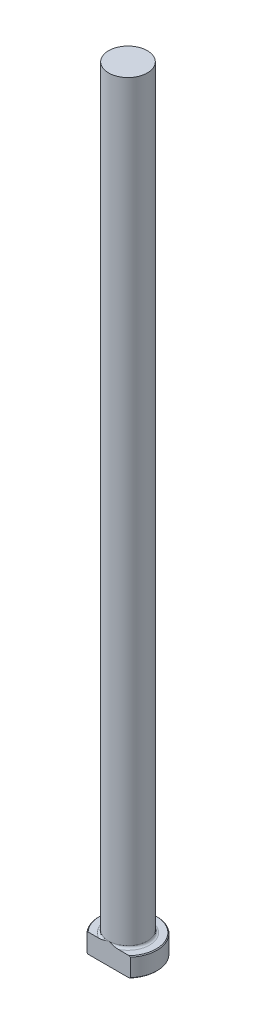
from build123d import *

# Parameters (mm, degrees)
CHAMFER1_SIZE = 0.254
FILLET1_R     = 0.762
KEY_DEPTH     = 255.356936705


with BuildPart() as part:
    # Sketch1 → Revolve1 (revolve)
    with BuildSketch(Plane.XY, mode=Mode.PRIVATE) as revolve1_sk:
        Polygon((0, 0), (-9.525, 0), (-9.525, 6.35), (-6.35, 6.35), (-6.35, 254), (0, 254), align=None)
    revolve(revolve1_sk.sketch.rotate(Axis((0, 259.958771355, 0), (0, -1, 0)), 270), axis=Axis((0, 259.958771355, 0), (0, -1, 0)))

    # Chamfer1
    chamfer1_edges = [part.edges().sort_by_distance(p)[0] for p in [
        (0, 6.35, -9.525),
        (0, 0, -9.525),
    ]]
    chamfer(chamfer1_edges, length=CHAMFER1_SIZE)

    # Fillet1
    fillet1_edges = [part.edges().sort_by_distance(p)[0] for p in [
        (0, 6.35, -6.35),
    ]]
    fillet(fillet1_edges, radius=FILLET1_R)

    # Sketch2 → KEY (cut, through all)
    with BuildSketch(Plane.XZ):
        with BuildLine():
            Line((-7.099515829, 6.35), (7.099515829, 6.35))
            ThreePointArc((7.099515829, 6.35), (0, 9.525), (-7.099515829, 6.35))
        make_face()
    extrude(amount=-KEY_DEPTH, mode=Mode.SUBTRACT)


solid = part.part
